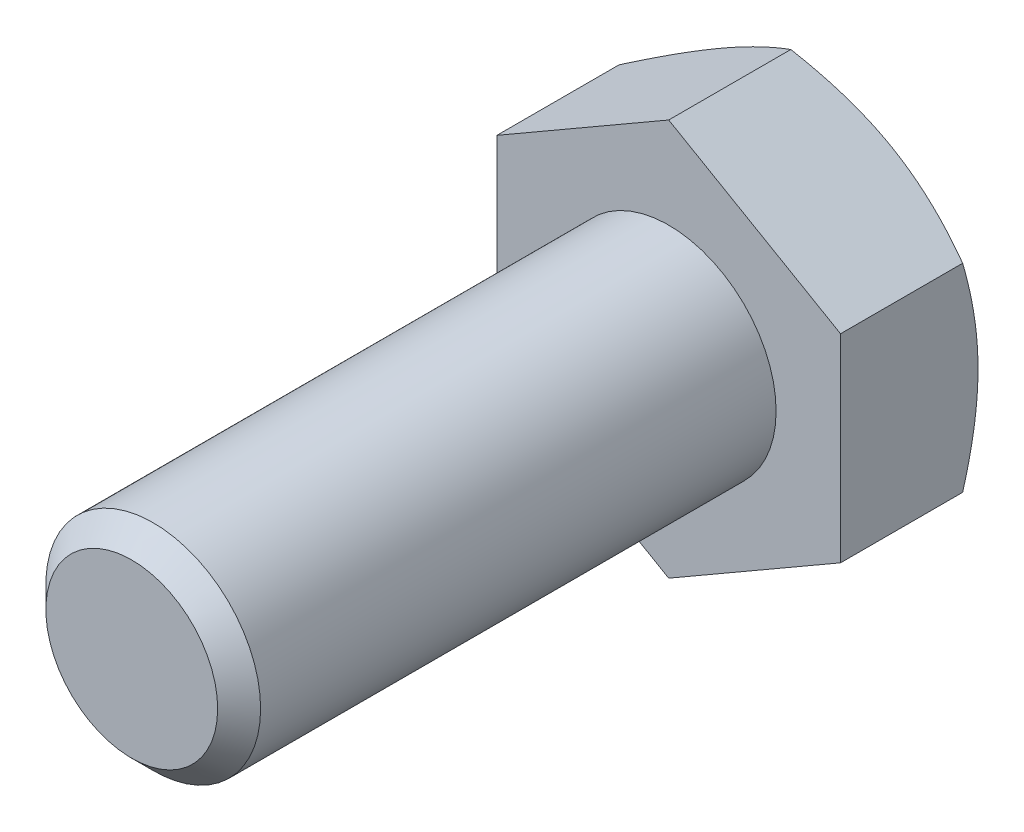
from build123d import *

# Parameters (mm, degrees)
ESQUISSE1_W        = 5
ESQUISSE1_H        = 25
CHANFREIN1_SIZE    = 1
BOSS_EXTRU_1_DEPTH = 6.4


with BuildPart() as part:
    # Esquisse1 → Base-R_volution (revolve)
    with BuildSketch(Plane(origin=(0, 0, 0), x_dir=(1, 0, 0), z_dir=(0, 1, 0))):
        with Locations((2.5, -12.5)):
            Rectangle(ESQUISSE1_W, ESQUISSE1_H)
    revolve(axis=Axis((0, 0, 0), (0, 0, 1)))

    # Chanfrein1
    chanfrein1_edges = [part.edges().sort_by_distance(p)[0] for p in [
        (-5, 0, 25),
    ]]
    chamfer(chanfrein1_edges, length=CHANFREIN1_SIZE)

    # Esquisse6 → Boss.-Extru.1 (add)
    with BuildSketch(Plane.XY):
        Polygon((8, -4.618802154), (8, 4.618802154), (0, 9.237604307), (-8, 4.618802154), (-8, -4.618802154), (0, -9.237604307), align=None)
    extrude(amount=-BOSS_EXTRU_1_DEPTH)

    # Esquisse7 → Enl_vement de mati_re-R_volution1 (revolve, cut)
    with BuildSketch(Plane(origin=(0, 0, 0), x_dir=(1, 0, 0), z_dir=(0, 1, 0))):
        Polygon((-8, 6.4), (-19.085125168, 6.4), (-19.085125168, 0), align=None)
    revolve(axis=Axis((0, 0, -6.239446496), (0, 0, 1)), mode=Mode.SUBTRACT)


solid = part.part
